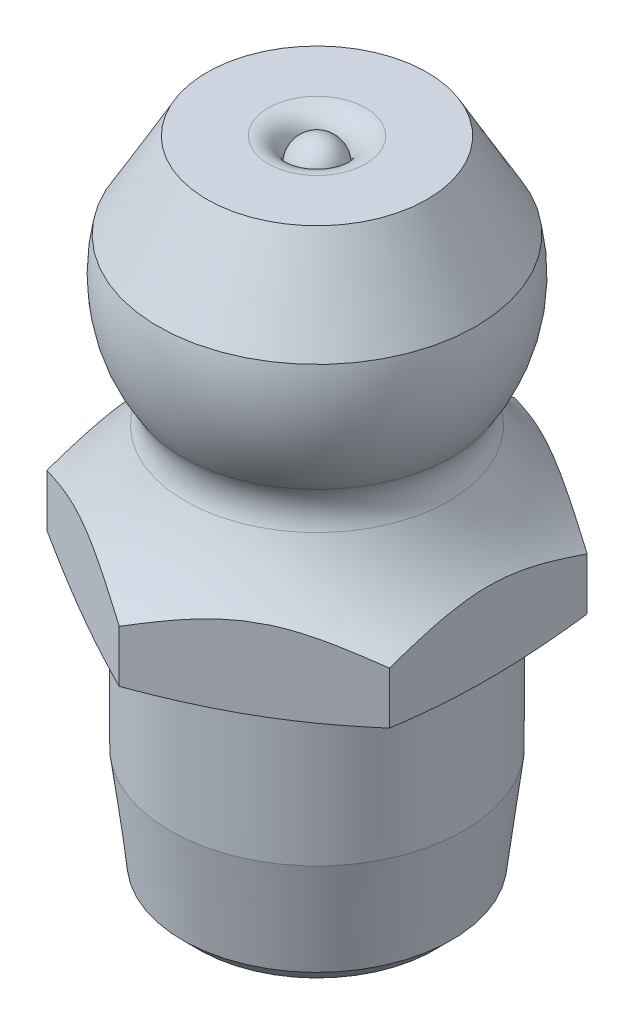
from build123d import *

# Parameters (mm, degrees)
SKETCH4_OUTSIDE_W = 13.574
SKETCH4_OUTSIDE_H = 13.574
CUT_KEY_DEPTH     = 15.384250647


with BuildPart() as part:
    # Sketch6 → body (revolve)
    with BuildSketch(Plane.XY):
        with BuildLine():
            Line((0.992845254, 13.2), (2.25, 13.2))
            Line((2.25, 13.2), (3.25, 11.45255235))
            ThreePointArc((3.25, 11.45255235), (3.263671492, 10.119347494), (2.752432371, 8.887983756))
            ThreePointArc((2.752432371, 8.887983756), (2.616668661, 8.494453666), (2.697011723, 8.085989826))
            ThreePointArc((2.697011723, 8.085989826), (3.268727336, 7.226263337), (4.041451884, 6.541511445))
            Line((4.041451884, 6.541511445), (4.041451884, 5.479056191))
            Line((4.041451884, 5.479056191), (3, 5.2))
            Line((3, 5.2), (3, 2.4))
            Line((3, 2.4), (2.746726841, 0.337255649))
            Line((2.746726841, 0.337255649), (2.409471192, 0))
            Line((2.409471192, 0), (0, 0))
            Line((0, 0), (0, 13.2))
            ThreePointArc((0, 13.2), (0.351023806, 13.054601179), (0.496422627, 12.703577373))
            ThreePointArc((0.496422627, 12.703577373), (0.641821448, 13.054601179), (0.992845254, 13.2))
        make_face()
    revolve(axis=Axis((0, 0, 0), (0, 1, 0)))

    # Sketch4 outside → cut-key (cut, through all)
    with BuildSketch(Plane(origin=(0, 0, 0), x_dir=(1, 0, 0), z_dir=(0, 1, 0))):
        Rectangle(SKETCH4_OUTSIDE_W, SKETCH4_OUTSIDE_H)
        Polygon((3.5, -2.020725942), (3.5, 2.020725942), (0, 4.041451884), (-3.5, 2.020725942), (-3.5, -2.020725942), (0, -4.041451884), align=None, mode=Mode.SUBTRACT)
    extrude(amount=CUT_KEY_DEPTH, mode=Mode.SUBTRACT)


solid = part.part
